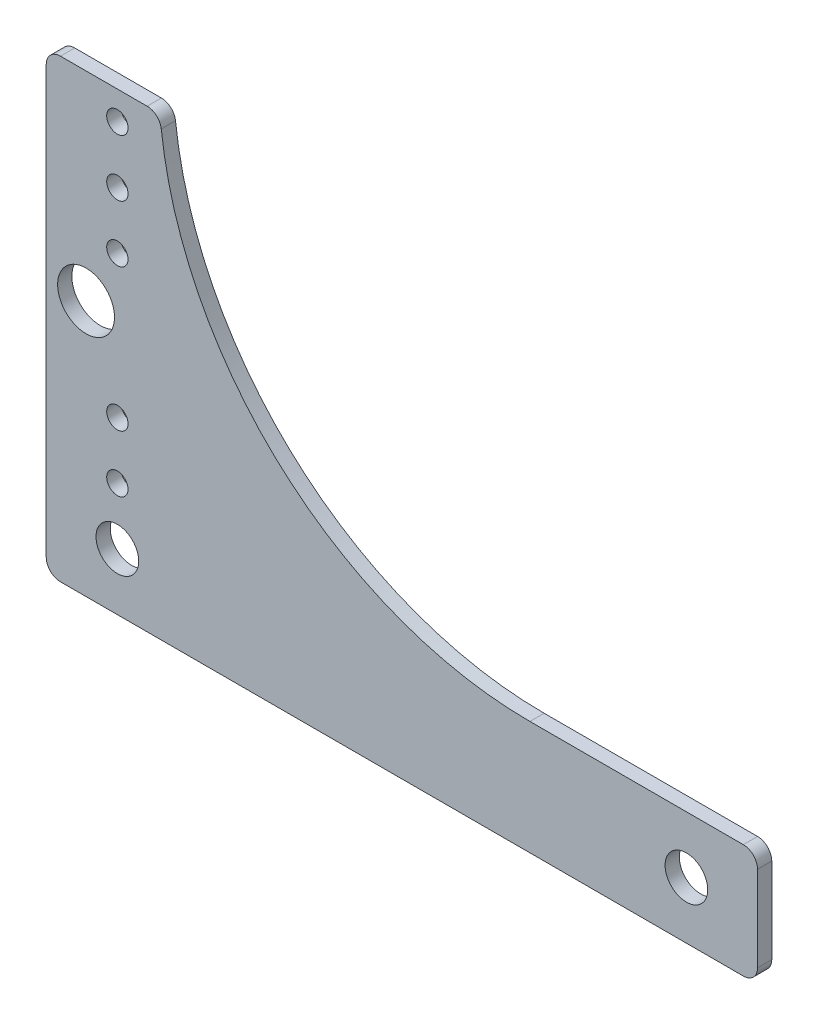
ISO-10303-21;
HEADER;
FILE_DESCRIPTION(('STEP AP214'),'2;1');
FILE_NAME('part.step','',(''),(''),'','','');
FILE_SCHEMA(('AUTOMOTIVE_DESIGN { 1 0 10303 214 1 1 1 1 }'));
ENDSEC;
DATA;
#1=APPLICATION_CONTEXT('core data for automotive mechanical design processes');
#2=APPLICATION_PROTOCOL_DEFINITION('international standard','automotive_design',2000,#1);
#3=PRODUCT_CONTEXT('',#1,'mechanical');
#4=PRODUCT('Part','Part','',(#3));
#5=PRODUCT_RELATED_PRODUCT_CATEGORY('part','',(#4));
#6=PRODUCT_DEFINITION_FORMATION('','',#4);
#7=PRODUCT_DEFINITION_CONTEXT('part definition',#1,'design');
#8=PRODUCT_DEFINITION('design','',#6,#7);
#9=PRODUCT_DEFINITION_SHAPE('','',#8);
#10=(LENGTH_UNIT() NAMED_UNIT(*) SI_UNIT(.MILLI.,.METRE.));
#11=(NAMED_UNIT(*) PLANE_ANGLE_UNIT() SI_UNIT($,.RADIAN.));
#12=(NAMED_UNIT(*) SI_UNIT($,.STERADIAN.) SOLID_ANGLE_UNIT());
#13=UNCERTAINTY_MEASURE_WITH_UNIT(LENGTH_MEASURE(1.E-05),#10,'distance_accuracy_value','');
#14=(GEOMETRIC_REPRESENTATION_CONTEXT(3) GLOBAL_UNCERTAINTY_ASSIGNED_CONTEXT((#13)) GLOBAL_UNIT_ASSIGNED_CONTEXT((#10,
#11,#12)) REPRESENTATION_CONTEXT('',''));
#15=CARTESIAN_POINT('',(0.,0.,0.));
#16=DIRECTION('',(0.,0.,1.));
#17=DIRECTION('',(1.,0.,0.));
#18=AXIS2_PLACEMENT_3D('',#15,#16,#17);
#19=CARTESIAN_POINT('',(158.75,25.4,3.175));
#20=DIRECTION('',(0.,1.,0.));
#21=DIRECTION('',(-1.,0.,0.));
#22=AXIS2_PLACEMENT_3D('',#19,#20,#21);
#23=PLANE('',#22);
#24=DIRECTION('',(-1.,0.,0.));
#25=VECTOR('',#24,1.);
#26=CARTESIAN_POINT('',(158.75,25.4,3.175));
#27=LINE('',#26,#25);
#28=CARTESIAN_POINT('',(155.575,25.4,3.175));
#29=VERTEX_POINT('',#28);
#30=CARTESIAN_POINT('',(107.95,25.4,3.175));
#31=VERTEX_POINT('',#30);
#32=EDGE_CURVE('E126',#29,#31,#27,.T.);
#33=ORIENTED_EDGE('',*,*,#32,.F.);
#34=DIRECTION('',(0.,0.,1.));
#35=VECTOR('',#34,1.);
#36=CARTESIAN_POINT('',(155.575,25.4,3.175));
#37=LINE('',#36,#35);
#38=CARTESIAN_POINT('',(155.575,25.4,0.));
#39=VERTEX_POINT('',#38);
#40=EDGE_CURVE('E49',#29,#39,#37,.F.);
#41=ORIENTED_EDGE('',*,*,#40,.T.);
#42=DIRECTION('',(1.,0.,0.));
#43=VECTOR('',#42,1.);
#44=CARTESIAN_POINT('',(107.95,25.4,0.));
#45=LINE('',#44,#43);
#46=CARTESIAN_POINT('',(107.95,25.4,0.));
#47=VERTEX_POINT('',#46);
#48=EDGE_CURVE('E140',#39,#47,#45,.F.);
#49=ORIENTED_EDGE('',*,*,#48,.T.);
#50=DIRECTION('',(0.,0.,1.));
#51=VECTOR('',#50,1.);
#52=CARTESIAN_POINT('',(107.95,25.4,3.175));
#53=LINE('',#52,#51);
#54=EDGE_CURVE('E139',#47,#31,#53,.T.);
#55=ORIENTED_EDGE('',*,*,#54,.T.);
#56=EDGE_LOOP('',(#33,#41,#49,#55));
#57=FACE_BOUND('',#56,.T.);
#58=ADVANCED_FACE('F41',(#57),#23,.T.);
#59=CARTESIAN_POINT('',(107.95,108.214583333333,3.175));
#60=DIRECTION('',(0.,0.,-1.));
#61=DIRECTION('',(-1.,0.,0.));
#62=AXIS2_PLACEMENT_3D('',#59,#60,#61);
#63=CYLINDRICAL_SURFACE('',#62,82.8145833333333);
#64=CARTESIAN_POINT('',(107.95,108.214583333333,0.));
#65=DIRECTION('',(0.,0.,-1.));
#66=DIRECTION('',(-1.,0.,0.));
#67=AXIS2_PLACEMENT_3D('',#64,#65,#66);
#68=CIRCLE('',#67,82.8145833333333);
#69=CARTESIAN_POINT('',(25.673844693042,98.7864615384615,0.));
#70=VERTEX_POINT('',#69);
#71=EDGE_CURVE('E168',#47,#70,#68,.T.);
#72=ORIENTED_EDGE('',*,*,#71,.T.);
#73=DIRECTION('',(0.,0.,-1.));
#74=VECTOR('',#73,1.);
#75=CARTESIAN_POINT('',(25.673844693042,98.7864615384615,3.175));
#76=LINE('',#75,#74);
#77=CARTESIAN_POINT('',(25.673844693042,98.7864615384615,3.175));
#78=VERTEX_POINT('',#77);
#79=EDGE_CURVE('E11',#70,#78,#76,.F.);
#80=ORIENTED_EDGE('',*,*,#79,.T.);
#81=CARTESIAN_POINT('',(107.95,108.214583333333,3.175));
#82=DIRECTION('',(0.,0.,-1.));
#83=DIRECTION('',(1.,0.,0.));
#84=AXIS2_PLACEMENT_3D('',#81,#82,#83);
#85=CIRCLE('',#84,82.8145833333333);
#86=EDGE_CURVE('E131',#31,#78,#85,.T.);
#87=ORIENTED_EDGE('',*,*,#86,.F.);
#88=ORIENTED_EDGE('',*,*,#54,.F.);
#89=EDGE_LOOP('',(#72,#80,#87,#88));
#90=FACE_BOUND('',#89,.T.);
#91=ADVANCED_FACE('F147',(#90),#63,.F.);
#92=CARTESIAN_POINT('',(0.,101.6,3.175));
#93=DIRECTION('',(0.,1.,0.));
#94=DIRECTION('',(-1.,0.,0.));
#95=AXIS2_PLACEMENT_3D('',#92,#93,#94);
#96=PLANE('',#95);
#97=DIRECTION('',(1.,0.,0.));
#98=VECTOR('',#97,1.);
#99=CARTESIAN_POINT('',(107.95,101.6,0.));
#100=LINE('',#99,#98);
#101=CARTESIAN_POINT('',(22.5194873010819,101.6,0.));
#102=VERTEX_POINT('',#101);
#103=CARTESIAN_POINT('',(3.175,101.6,0.));
#104=VERTEX_POINT('',#103);
#105=EDGE_CURVE('E165',#102,#104,#100,.F.);
#106=ORIENTED_EDGE('',*,*,#105,.T.);
#107=DIRECTION('',(0.,0.,1.));
#108=VECTOR('',#107,1.);
#109=CARTESIAN_POINT('',(3.175,101.6,3.175));
#110=LINE('',#109,#108);
#111=CARTESIAN_POINT('',(3.175,101.6,3.175));
#112=VERTEX_POINT('',#111);
#113=EDGE_CURVE('E173',#104,#112,#110,.T.);
#114=ORIENTED_EDGE('',*,*,#113,.T.);
#115=DIRECTION('',(-1.,0.,0.));
#116=VECTOR('',#115,1.);
#117=CARTESIAN_POINT('',(0.,101.6,3.175));
#118=LINE('',#117,#116);
#119=CARTESIAN_POINT('',(22.5194873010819,101.6,3.175));
#120=VERTEX_POINT('',#119);
#121=EDGE_CURVE('E149',#120,#112,#118,.T.);
#122=ORIENTED_EDGE('',*,*,#121,.F.);
#123=DIRECTION('',(0.,0.,-1.));
#124=VECTOR('',#123,1.);
#125=CARTESIAN_POINT('',(22.5194873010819,101.6,3.175));
#126=LINE('',#125,#124);
#127=EDGE_CURVE('E144',#120,#102,#126,.T.);
#128=ORIENTED_EDGE('',*,*,#127,.T.);
#129=EDGE_LOOP('',(#106,#114,#122,#128));
#130=FACE_BOUND('',#129,.T.);
#131=ADVANCED_FACE('F310',(#130),#96,.T.);
#132=CARTESIAN_POINT('',(0.,0.,3.175));
#133=DIRECTION('',(-1.,0.,0.));
#134=DIRECTION('',(0.,-1.,0.));
#135=AXIS2_PLACEMENT_3D('',#132,#133,#134);
#136=PLANE('',#135);
#137=DIRECTION('',(0.,-1.,0.));
#138=VECTOR('',#137,1.);
#139=CARTESIAN_POINT('',(0.,0.,3.175));
#140=LINE('',#139,#138);
#141=CARTESIAN_POINT('',(0.,98.425,3.175));
#142=VERTEX_POINT('',#141);
#143=CARTESIAN_POINT('',(0.,3.175,3.175));
#144=VERTEX_POINT('',#143);
#145=EDGE_CURVE('E145',#142,#144,#140,.T.);
#146=ORIENTED_EDGE('',*,*,#145,.F.);
#147=DIRECTION('',(0.,0.,1.));
#148=VECTOR('',#147,1.);
#149=CARTESIAN_POINT('',(0.,98.425,3.175));
#150=LINE('',#149,#148);
#151=CARTESIAN_POINT('',(0.,98.425,0.));
#152=VERTEX_POINT('',#151);
#153=EDGE_CURVE('E188',#142,#152,#150,.F.);
#154=ORIENTED_EDGE('',*,*,#153,.T.);
#155=DIRECTION('',(0.,1.,0.));
#156=VECTOR('',#155,1.);
#157=CARTESIAN_POINT('',(0.,108.214583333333,0.));
#158=LINE('',#157,#156);
#159=CARTESIAN_POINT('',(0.,3.175,0.));
#160=VERTEX_POINT('',#159);
#161=EDGE_CURVE('E161',#152,#160,#158,.F.);
#162=ORIENTED_EDGE('',*,*,#161,.T.);
#163=DIRECTION('',(0.,0.,1.));
#164=VECTOR('',#163,1.);
#165=CARTESIAN_POINT('',(0.,3.175,3.175));
#166=LINE('',#165,#164);
#167=EDGE_CURVE('E185',#160,#144,#166,.T.);
#168=ORIENTED_EDGE('',*,*,#167,.T.);
#169=EDGE_LOOP('',(#146,#154,#162,#168));
#170=FACE_BOUND('',#169,.T.);
#171=ADVANCED_FACE('F344',(#170),#136,.T.);
#172=CARTESIAN_POINT('',(0.,0.,3.175));
#173=DIRECTION('',(0.,-1.,0.));
#174=DIRECTION('',(1.,0.,0.));
#175=AXIS2_PLACEMENT_3D('',#172,#173,#174);
#176=PLANE('',#175);
#177=DIRECTION('',(1.,0.,0.));
#178=VECTOR('',#177,1.);
#179=CARTESIAN_POINT('',(0.,0.,3.175));
#180=LINE('',#179,#178);
#181=CARTESIAN_POINT('',(3.175,0.,3.175));
#182=VERTEX_POINT('',#181);
#183=CARTESIAN_POINT('',(155.575,0.,3.175));
#184=VERTEX_POINT('',#183);
#185=EDGE_CURVE('E164',#182,#184,#180,.T.);
#186=ORIENTED_EDGE('',*,*,#185,.F.);
#187=DIRECTION('',(0.,0.,1.));
#188=VECTOR('',#187,1.);
#189=CARTESIAN_POINT('',(3.175,0.,3.175));
#190=LINE('',#189,#188);
#191=CARTESIAN_POINT('',(3.175,0.,0.));
#192=VERTEX_POINT('',#191);
#193=EDGE_CURVE('E202',#182,#192,#190,.F.);
#194=ORIENTED_EDGE('',*,*,#193,.T.);
#195=DIRECTION('',(1.,0.,0.));
#196=VECTOR('',#195,1.);
#197=CARTESIAN_POINT('',(107.95,0.,0.));
#198=LINE('',#197,#196);
#199=CARTESIAN_POINT('',(155.575,0.,0.));
#200=VERTEX_POINT('',#199);
#201=EDGE_CURVE('E156',#192,#200,#198,.T.);
#202=ORIENTED_EDGE('',*,*,#201,.T.);
#203=DIRECTION('',(0.,0.,1.));
#204=VECTOR('',#203,1.);
#205=CARTESIAN_POINT('',(155.575,0.,3.175));
#206=LINE('',#205,#204);
#207=EDGE_CURVE('E199',#200,#184,#206,.T.);
#208=ORIENTED_EDGE('',*,*,#207,.T.);
#209=EDGE_LOOP('',(#186,#194,#202,#208));
#210=FACE_BOUND('',#209,.T.);
#211=ADVANCED_FACE('F316',(#210),#176,.T.);
#212=CARTESIAN_POINT('',(158.75,0.,3.175));
#213=DIRECTION('',(1.,0.,0.));
#214=DIRECTION('',(0.,1.,0.));
#215=AXIS2_PLACEMENT_3D('',#212,#213,#214);
#216=PLANE('',#215);
#217=DIRECTION('',(0.,1.,0.));
#218=VECTOR('',#217,1.);
#219=CARTESIAN_POINT('',(158.75,0.,3.175));
#220=LINE('',#219,#218);
#221=CARTESIAN_POINT('',(158.75,3.175,3.175));
#222=VERTEX_POINT('',#221);
#223=CARTESIAN_POINT('',(158.75,22.225,3.175));
#224=VERTEX_POINT('',#223);
#225=EDGE_CURVE('E136',#222,#224,#220,.T.);
#226=ORIENTED_EDGE('',*,*,#225,.F.);
#227=DIRECTION('',(0.,0.,1.));
#228=VECTOR('',#227,1.);
#229=CARTESIAN_POINT('',(158.75,3.175,3.175));
#230=LINE('',#229,#228);
#231=CARTESIAN_POINT('',(158.75,3.175,0.));
#232=VERTEX_POINT('',#231);
#233=EDGE_CURVE('E63',#222,#232,#230,.F.);
#234=ORIENTED_EDGE('',*,*,#233,.T.);
#235=DIRECTION('',(0.,1.,0.));
#236=VECTOR('',#235,1.);
#237=CARTESIAN_POINT('',(158.75,108.214583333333,0.));
#238=LINE('',#237,#236);
#239=CARTESIAN_POINT('',(158.75,22.225,0.));
#240=VERTEX_POINT('',#239);
#241=EDGE_CURVE('E159',#232,#240,#238,.T.);
#242=ORIENTED_EDGE('',*,*,#241,.T.);
#243=DIRECTION('',(0.,0.,1.));
#244=VECTOR('',#243,1.);
#245=CARTESIAN_POINT('',(158.75,22.225,3.175));
#246=LINE('',#245,#244);
#247=EDGE_CURVE('E204',#240,#224,#246,.T.);
#248=ORIENTED_EDGE('',*,*,#247,.T.);
#249=EDGE_LOOP('',(#226,#234,#242,#248));
#250=FACE_BOUND('',#249,.T.);
#251=ADVANCED_FACE('F212',(#250),#216,.T.);
#252=CARTESIAN_POINT('',(107.95,108.214583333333,3.175));
#253=DIRECTION('',(0.,0.,1.));
#254=DIRECTION('',(1.,0.,0.));
#255=AXIS2_PLACEMENT_3D('',#252,#253,#254);
#256=PLANE('',#255);
#257=CARTESIAN_POINT('',(142.875,12.6999999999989,3.175));
#258=DIRECTION('',(0.,0.,1.));
#259=DIRECTION('',(1.,0.,0.));
#260=AXIS2_PLACEMENT_3D('',#257,#258,#259);
#261=CIRCLE('',#260,4.76250000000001);
#262=CARTESIAN_POINT('',(147.6375,12.6999999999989,3.175));
#263=VERTEX_POINT('',#262);
#264=EDGE_CURVE('E258',#263,#263,#261,.T.);
#265=ORIENTED_EDGE('',*,*,#264,.F.);
#266=EDGE_LOOP('',(#265));
#267=FACE_BOUND('',#266,.T.);
#268=CARTESIAN_POINT('',(15.8750000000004,95.2499999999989,3.175));
#269=DIRECTION('',(0.,0.,-1.));
#270=DIRECTION('',(-1.,0.,0.));
#271=AXIS2_PLACEMENT_3D('',#268,#269,#270);
#272=CIRCLE('',#271,2.38125);
#273=CARTESIAN_POINT('',(13.4937500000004,95.2499999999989,3.175));
#274=VERTEX_POINT('',#273);
#275=EDGE_CURVE('E252',#274,#274,#272,.F.);
#276=ORIENTED_EDGE('',*,*,#275,.F.);
#277=EDGE_LOOP('',(#276));
#278=FACE_BOUND('',#277,.T.);
#279=CARTESIAN_POINT('',(15.8750000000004,82.5499999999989,3.175));
#280=DIRECTION('',(0.,0.,-1.));
#281=DIRECTION('',(-1.,0.,0.));
#282=AXIS2_PLACEMENT_3D('',#279,#280,#281);
#283=CIRCLE('',#282,2.38125);
#284=CARTESIAN_POINT('',(13.4937500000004,82.5499999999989,3.175));
#285=VERTEX_POINT('',#284);
#286=EDGE_CURVE('E246',#285,#285,#283,.F.);
#287=ORIENTED_EDGE('',*,*,#286,.F.);
#288=EDGE_LOOP('',(#287));
#289=FACE_BOUND('',#288,.T.);
#290=CARTESIAN_POINT('',(15.8750000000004,69.8499999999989,3.175));
#291=DIRECTION('',(0.,0.,-1.));
#292=DIRECTION('',(-1.,0.,0.));
#293=AXIS2_PLACEMENT_3D('',#290,#291,#292);
#294=CIRCLE('',#293,2.38125);
#295=CARTESIAN_POINT('',(13.4937500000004,69.8499999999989,3.175));
#296=VERTEX_POINT('',#295);
#297=EDGE_CURVE('E240',#296,#296,#294,.F.);
#298=ORIENTED_EDGE('',*,*,#297,.F.);
#299=EDGE_LOOP('',(#298));
#300=FACE_BOUND('',#299,.T.);
#301=CARTESIAN_POINT('',(8.89000000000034,57.1499999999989,3.175));
#302=DIRECTION('',(0.,0.,-1.));
#303=DIRECTION('',(-1.,0.,0.));
#304=AXIS2_PLACEMENT_3D('',#301,#302,#303);
#305=CIRCLE('',#304,6.35);
#306=CARTESIAN_POINT('',(2.54000000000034,57.1499999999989,3.175));
#307=VERTEX_POINT('',#306);
#308=EDGE_CURVE('E234',#307,#307,#305,.F.);
#309=ORIENTED_EDGE('',*,*,#308,.F.);
#310=EDGE_LOOP('',(#309));
#311=FACE_BOUND('',#310,.T.);
#312=CARTESIAN_POINT('',(15.8750000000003,38.0999999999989,3.175));
#313=DIRECTION('',(0.,0.,-1.));
#314=DIRECTION('',(-1.,0.,0.));
#315=AXIS2_PLACEMENT_3D('',#312,#313,#314);
#316=CIRCLE('',#315,2.38125);
#317=CARTESIAN_POINT('',(13.4937500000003,38.0999999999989,3.175));
#318=VERTEX_POINT('',#317);
#319=EDGE_CURVE('E228',#318,#318,#316,.F.);
#320=ORIENTED_EDGE('',*,*,#319,.F.);
#321=EDGE_LOOP('',(#320));
#322=FACE_BOUND('',#321,.T.);
#323=CARTESIAN_POINT('',(15.8750000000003,25.3999999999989,3.175));
#324=DIRECTION('',(0.,0.,-1.));
#325=DIRECTION('',(-1.,0.,0.));
#326=AXIS2_PLACEMENT_3D('',#323,#324,#325);
#327=CIRCLE('',#326,2.38125);
#328=CARTESIAN_POINT('',(13.4937500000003,25.3999999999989,3.175));
#329=VERTEX_POINT('',#328);
#330=EDGE_CURVE('E222',#329,#329,#327,.F.);
#331=ORIENTED_EDGE('',*,*,#330,.F.);
#332=EDGE_LOOP('',(#331));
#333=FACE_BOUND('',#332,.T.);
#334=CARTESIAN_POINT('',(15.8750000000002,12.6999999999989,3.175));
#335=DIRECTION('',(0.,0.,-1.));
#336=DIRECTION('',(-1.,0.,0.));
#337=AXIS2_PLACEMENT_3D('',#334,#335,#336);
#338=CIRCLE('',#337,4.7625);
#339=CARTESIAN_POINT('',(11.1125000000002,12.6999999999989,3.175));
#340=VERTEX_POINT('',#339);
#341=EDGE_CURVE('E216',#340,#340,#338,.F.);
#342=ORIENTED_EDGE('',*,*,#341,.F.);
#343=EDGE_LOOP('',(#342));
#344=FACE_BOUND('',#343,.T.);
#345=ORIENTED_EDGE('',*,*,#121,.T.);
#346=CARTESIAN_POINT('',(3.175,98.425,3.175));
#347=DIRECTION('',(0.,0.,1.));
#348=DIRECTION('',(1.,0.,0.));
#349=AXIS2_PLACEMENT_3D('',#346,#347,#348);
#350=CIRCLE('',#349,3.175);
#351=EDGE_CURVE('E183',#112,#142,#350,.T.);
#352=ORIENTED_EDGE('',*,*,#351,.T.);
#353=ORIENTED_EDGE('',*,*,#145,.T.);
#354=CARTESIAN_POINT('',(3.175,3.175,3.175));
#355=DIRECTION('',(0.,0.,1.));
#356=DIRECTION('',(1.,0.,0.));
#357=AXIS2_PLACEMENT_3D('',#354,#355,#356);
#358=CIRCLE('',#357,3.175);
#359=EDGE_CURVE('E181',#144,#182,#358,.T.);
#360=ORIENTED_EDGE('',*,*,#359,.T.);
#361=ORIENTED_EDGE('',*,*,#185,.T.);
#362=CARTESIAN_POINT('',(155.575,3.175,3.175));
#363=DIRECTION('',(0.,0.,1.));
#364=DIRECTION('',(1.,0.,0.));
#365=AXIS2_PLACEMENT_3D('',#362,#363,#364);
#366=CIRCLE('',#365,3.175);
#367=EDGE_CURVE('E179',#184,#222,#366,.T.);
#368=ORIENTED_EDGE('',*,*,#367,.T.);
#369=ORIENTED_EDGE('',*,*,#225,.T.);
#370=CARTESIAN_POINT('',(155.575,22.225,3.175));
#371=DIRECTION('',(0.,0.,1.));
#372=DIRECTION('',(1.,0.,0.));
#373=AXIS2_PLACEMENT_3D('',#370,#371,#372);
#374=CIRCLE('',#373,3.175);
#375=EDGE_CURVE('E133',#224,#29,#374,.T.);
#376=ORIENTED_EDGE('',*,*,#375,.T.);
#377=ORIENTED_EDGE('',*,*,#32,.T.);
#378=ORIENTED_EDGE('',*,*,#86,.T.);
#379=CARTESIAN_POINT('',(22.5194873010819,98.425,3.175));
#380=DIRECTION('',(0.,0.,1.));
#381=DIRECTION('',(1.,0.,0.));
#382=AXIS2_PLACEMENT_3D('',#379,#380,#381);
#383=CIRCLE('',#382,3.175);
#384=EDGE_CURVE('E176',#78,#120,#383,.T.);
#385=ORIENTED_EDGE('',*,*,#384,.T.);
#386=EDGE_LOOP('',(#345,#352,#353,#360,#361,#368,#369,#376,#377,#378,#385));
#387=FACE_BOUND('',#386,.T.);
#388=ADVANCED_FACE('F129',(#267,#278,#289,#300,#311,#322,#333,#344,#387),#256,.T.);
#389=CARTESIAN_POINT('',(107.95,108.214583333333,0.));
#390=DIRECTION('',(0.,0.,1.));
#391=DIRECTION('',(1.,0.,0.));
#392=AXIS2_PLACEMENT_3D('',#389,#390,#391);
#393=PLANE('',#392);
#394=CARTESIAN_POINT('',(142.875,12.6999999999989,0.));
#395=DIRECTION('',(0.,0.,1.));
#396=DIRECTION('',(1.,0.,0.));
#397=AXIS2_PLACEMENT_3D('',#394,#395,#396);
#398=CIRCLE('',#397,4.76250000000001);
#399=CARTESIAN_POINT('',(147.6375,12.6999999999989,0.));
#400=VERTEX_POINT('',#399);
#401=EDGE_CURVE('E255',#400,#400,#398,.T.);
#402=ORIENTED_EDGE('',*,*,#401,.T.);
#403=EDGE_LOOP('',(#402));
#404=FACE_BOUND('',#403,.T.);
#405=CARTESIAN_POINT('',(15.8750000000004,95.2499999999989,0.));
#406=DIRECTION('',(0.,0.,-1.));
#407=DIRECTION('',(-1.,0.,0.));
#408=AXIS2_PLACEMENT_3D('',#405,#406,#407);
#409=CIRCLE('',#408,2.38125);
#410=CARTESIAN_POINT('',(13.4937500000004,95.2499999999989,0.));
#411=VERTEX_POINT('',#410);
#412=EDGE_CURVE('E249',#411,#411,#409,.F.);
#413=ORIENTED_EDGE('',*,*,#412,.T.);
#414=EDGE_LOOP('',(#413));
#415=FACE_BOUND('',#414,.T.);
#416=CARTESIAN_POINT('',(15.8750000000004,82.5499999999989,0.));
#417=DIRECTION('',(0.,0.,-1.));
#418=DIRECTION('',(-1.,0.,0.));
#419=AXIS2_PLACEMENT_3D('',#416,#417,#418);
#420=CIRCLE('',#419,2.38125);
#421=CARTESIAN_POINT('',(13.4937500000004,82.5499999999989,0.));
#422=VERTEX_POINT('',#421);
#423=EDGE_CURVE('E243',#422,#422,#420,.F.);
#424=ORIENTED_EDGE('',*,*,#423,.T.);
#425=EDGE_LOOP('',(#424));
#426=FACE_BOUND('',#425,.T.);
#427=CARTESIAN_POINT('',(15.8750000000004,69.8499999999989,0.));
#428=DIRECTION('',(0.,0.,-1.));
#429=DIRECTION('',(-1.,0.,0.));
#430=AXIS2_PLACEMENT_3D('',#427,#428,#429);
#431=CIRCLE('',#430,2.38125);
#432=CARTESIAN_POINT('',(13.4937500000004,69.8499999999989,0.));
#433=VERTEX_POINT('',#432);
#434=EDGE_CURVE('E237',#433,#433,#431,.F.);
#435=ORIENTED_EDGE('',*,*,#434,.T.);
#436=EDGE_LOOP('',(#435));
#437=FACE_BOUND('',#436,.T.);
#438=CARTESIAN_POINT('',(8.89000000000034,57.1499999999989,0.));
#439=DIRECTION('',(0.,0.,-1.));
#440=DIRECTION('',(-1.,0.,0.));
#441=AXIS2_PLACEMENT_3D('',#438,#439,#440);
#442=CIRCLE('',#441,6.35);
#443=CARTESIAN_POINT('',(2.54000000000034,57.1499999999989,0.));
#444=VERTEX_POINT('',#443);
#445=EDGE_CURVE('E231',#444,#444,#442,.F.);
#446=ORIENTED_EDGE('',*,*,#445,.T.);
#447=EDGE_LOOP('',(#446));
#448=FACE_BOUND('',#447,.T.);
#449=CARTESIAN_POINT('',(15.8750000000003,38.0999999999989,0.));
#450=DIRECTION('',(0.,0.,-1.));
#451=DIRECTION('',(-1.,0.,0.));
#452=AXIS2_PLACEMENT_3D('',#449,#450,#451);
#453=CIRCLE('',#452,2.38125);
#454=CARTESIAN_POINT('',(13.4937500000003,38.0999999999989,0.));
#455=VERTEX_POINT('',#454);
#456=EDGE_CURVE('E225',#455,#455,#453,.F.);
#457=ORIENTED_EDGE('',*,*,#456,.T.);
#458=EDGE_LOOP('',(#457));
#459=FACE_BOUND('',#458,.T.);
#460=CARTESIAN_POINT('',(15.8750000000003,25.3999999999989,0.));
#461=DIRECTION('',(0.,0.,-1.));
#462=DIRECTION('',(-1.,0.,0.));
#463=AXIS2_PLACEMENT_3D('',#460,#461,#462);
#464=CIRCLE('',#463,2.38125);
#465=CARTESIAN_POINT('',(13.4937500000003,25.3999999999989,0.));
#466=VERTEX_POINT('',#465);
#467=EDGE_CURVE('E219',#466,#466,#464,.F.);
#468=ORIENTED_EDGE('',*,*,#467,.T.);
#469=EDGE_LOOP('',(#468));
#470=FACE_BOUND('',#469,.T.);
#471=CARTESIAN_POINT('',(15.8750000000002,12.6999999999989,0.));
#472=DIRECTION('',(0.,0.,-1.));
#473=DIRECTION('',(-1.,0.,0.));
#474=AXIS2_PLACEMENT_3D('',#471,#472,#473);
#475=CIRCLE('',#474,4.7625);
#476=CARTESIAN_POINT('',(11.1125000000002,12.6999999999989,0.));
#477=VERTEX_POINT('',#476);
#478=EDGE_CURVE('E160',#477,#477,#475,.F.);
#479=ORIENTED_EDGE('',*,*,#478,.T.);
#480=EDGE_LOOP('',(#479));
#481=FACE_BOUND('',#480,.T.);
#482=ORIENTED_EDGE('',*,*,#161,.F.);
#483=CARTESIAN_POINT('',(3.175,98.425,0.));
#484=DIRECTION('',(0.,0.,1.));
#485=DIRECTION('',(1.,0.,0.));
#486=AXIS2_PLACEMENT_3D('',#483,#484,#485);
#487=CIRCLE('',#486,3.175);
#488=EDGE_CURVE('E197',#152,#104,#487,.F.);
#489=ORIENTED_EDGE('',*,*,#488,.T.);
#490=ORIENTED_EDGE('',*,*,#105,.F.);
#491=CARTESIAN_POINT('',(22.5194873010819,98.425,0.));
#492=DIRECTION('',(0.,0.,1.));
#493=DIRECTION('',(1.,0.,0.));
#494=AXIS2_PLACEMENT_3D('',#491,#492,#493);
#495=CIRCLE('',#494,3.175);
#496=EDGE_CURVE('E190',#102,#70,#495,.F.);
#497=ORIENTED_EDGE('',*,*,#496,.T.);
#498=ORIENTED_EDGE('',*,*,#71,.F.);
#499=ORIENTED_EDGE('',*,*,#48,.F.);
#500=CARTESIAN_POINT('',(155.575,22.225,0.));
#501=DIRECTION('',(0.,0.,1.));
#502=DIRECTION('',(1.,0.,0.));
#503=AXIS2_PLACEMENT_3D('',#500,#501,#502);
#504=CIRCLE('',#503,3.175);
#505=EDGE_CURVE('E56',#39,#240,#504,.F.);
#506=ORIENTED_EDGE('',*,*,#505,.T.);
#507=ORIENTED_EDGE('',*,*,#241,.F.);
#508=CARTESIAN_POINT('',(155.575,3.175,0.));
#509=DIRECTION('',(0.,0.,1.));
#510=DIRECTION('',(1.,0.,0.));
#511=AXIS2_PLACEMENT_3D('',#508,#509,#510);
#512=CIRCLE('',#511,3.175);
#513=EDGE_CURVE('E193',#232,#200,#512,.F.);
#514=ORIENTED_EDGE('',*,*,#513,.T.);
#515=ORIENTED_EDGE('',*,*,#201,.F.);
#516=CARTESIAN_POINT('',(3.175,3.175,0.));
#517=DIRECTION('',(0.,0.,1.));
#518=DIRECTION('',(1.,0.,0.));
#519=AXIS2_PLACEMENT_3D('',#516,#517,#518);
#520=CIRCLE('',#519,3.175);
#521=EDGE_CURVE('E195',#192,#160,#520,.F.);
#522=ORIENTED_EDGE('',*,*,#521,.T.);
#523=EDGE_LOOP('',(#482,#489,#490,#497,#498,#499,#506,#507,#514,#515,#522));
#524=FACE_BOUND('',#523,.T.);
#525=ADVANCED_FACE('F209',(#404,#415,#426,#437,#448,#459,#470,#481,#524),#393,.F.);
#526=CARTESIAN_POINT('',(15.8750000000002,12.6999999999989,0.));
#527=DIRECTION('',(0.,0.,1.));
#528=DIRECTION('',(0.,-1.,0.));
#529=AXIS2_PLACEMENT_3D('',#526,#527,#528);
#530=CYLINDRICAL_SURFACE('',#529,4.7625);
#531=ORIENTED_EDGE('',*,*,#478,.F.);
#532=EDGE_LOOP('',(#531));
#533=FACE_BOUND('',#532,.T.);
#534=ORIENTED_EDGE('',*,*,#341,.T.);
#535=EDGE_LOOP('',(#534));
#536=FACE_BOUND('',#535,.T.);
#537=ADVANCED_FACE('F291',(#533,#536),#530,.F.);
#538=CARTESIAN_POINT('',(15.8750000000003,25.3999999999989,0.));
#539=DIRECTION('',(0.,0.,1.));
#540=DIRECTION('',(0.,-1.,0.));
#541=AXIS2_PLACEMENT_3D('',#538,#539,#540);
#542=CYLINDRICAL_SURFACE('',#541,2.38125);
#543=ORIENTED_EDGE('',*,*,#467,.F.);
#544=EDGE_LOOP('',(#543));
#545=FACE_BOUND('',#544,.T.);
#546=ORIENTED_EDGE('',*,*,#330,.T.);
#547=EDGE_LOOP('',(#546));
#548=FACE_BOUND('',#547,.T.);
#549=ADVANCED_FACE('F293',(#545,#548),#542,.F.);
#550=CARTESIAN_POINT('',(15.8750000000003,38.0999999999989,0.));
#551=DIRECTION('',(0.,0.,1.));
#552=DIRECTION('',(0.,-1.,0.));
#553=AXIS2_PLACEMENT_3D('',#550,#551,#552);
#554=CYLINDRICAL_SURFACE('',#553,2.38125);
#555=ORIENTED_EDGE('',*,*,#456,.F.);
#556=EDGE_LOOP('',(#555));
#557=FACE_BOUND('',#556,.T.);
#558=ORIENTED_EDGE('',*,*,#319,.T.);
#559=EDGE_LOOP('',(#558));
#560=FACE_BOUND('',#559,.T.);
#561=ADVANCED_FACE('F300',(#557,#560),#554,.F.);
#562=CARTESIAN_POINT('',(8.89000000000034,57.1499999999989,0.));
#563=DIRECTION('',(0.,0.,1.));
#564=DIRECTION('',(0.,-1.,0.));
#565=AXIS2_PLACEMENT_3D('',#562,#563,#564);
#566=CYLINDRICAL_SURFACE('',#565,6.35);
#567=ORIENTED_EDGE('',*,*,#445,.F.);
#568=EDGE_LOOP('',(#567));
#569=FACE_BOUND('',#568,.T.);
#570=ORIENTED_EDGE('',*,*,#308,.T.);
#571=EDGE_LOOP('',(#570));
#572=FACE_BOUND('',#571,.T.);
#573=ADVANCED_FACE('F450',(#569,#572),#566,.F.);
#574=CARTESIAN_POINT('',(15.8750000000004,69.8499999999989,0.));
#575=DIRECTION('',(0.,0.,1.));
#576=DIRECTION('',(0.,-1.,0.));
#577=AXIS2_PLACEMENT_3D('',#574,#575,#576);
#578=CYLINDRICAL_SURFACE('',#577,2.38125);
#579=ORIENTED_EDGE('',*,*,#434,.F.);
#580=EDGE_LOOP('',(#579));
#581=FACE_BOUND('',#580,.T.);
#582=ORIENTED_EDGE('',*,*,#297,.T.);
#583=EDGE_LOOP('',(#582));
#584=FACE_BOUND('',#583,.T.);
#585=ADVANCED_FACE('F442',(#581,#584),#578,.F.);
#586=CARTESIAN_POINT('',(15.8750000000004,82.5499999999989,0.));
#587=DIRECTION('',(0.,0.,1.));
#588=DIRECTION('',(0.,-1.,0.));
#589=AXIS2_PLACEMENT_3D('',#586,#587,#588);
#590=CYLINDRICAL_SURFACE('',#589,2.38125);
#591=ORIENTED_EDGE('',*,*,#423,.F.);
#592=EDGE_LOOP('',(#591));
#593=FACE_BOUND('',#592,.T.);
#594=ORIENTED_EDGE('',*,*,#286,.T.);
#595=EDGE_LOOP('',(#594));
#596=FACE_BOUND('',#595,.T.);
#597=ADVANCED_FACE('F434',(#593,#596),#590,.F.);
#598=CARTESIAN_POINT('',(15.8750000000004,95.2499999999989,0.));
#599=DIRECTION('',(0.,0.,1.));
#600=DIRECTION('',(0.,-1.,0.));
#601=AXIS2_PLACEMENT_3D('',#598,#599,#600);
#602=CYLINDRICAL_SURFACE('',#601,2.38125);
#603=ORIENTED_EDGE('',*,*,#412,.F.);
#604=EDGE_LOOP('',(#603));
#605=FACE_BOUND('',#604,.T.);
#606=ORIENTED_EDGE('',*,*,#275,.T.);
#607=EDGE_LOOP('',(#606));
#608=FACE_BOUND('',#607,.T.);
#609=ADVANCED_FACE('F270',(#605,#608),#602,.F.);
#610=CARTESIAN_POINT('',(142.875,12.6999999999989,0.));
#611=DIRECTION('',(0.,0.,1.));
#612=DIRECTION('',(1.,0.,0.));
#613=AXIS2_PLACEMENT_3D('',#610,#611,#612);
#614=CYLINDRICAL_SURFACE('',#613,4.76250000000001);
#615=ORIENTED_EDGE('',*,*,#401,.F.);
#616=EDGE_LOOP('',(#615));
#617=FACE_BOUND('',#616,.T.);
#618=ORIENTED_EDGE('',*,*,#264,.T.);
#619=EDGE_LOOP('',(#618));
#620=FACE_BOUND('',#619,.T.);
#621=ADVANCED_FACE('F266',(#617,#620),#614,.F.);
#622=CARTESIAN_POINT('',(3.175,98.425,3.175));
#623=DIRECTION('',(0.,0.,1.));
#624=DIRECTION('',(1.,0.,0.));
#625=AXIS2_PLACEMENT_3D('',#622,#623,#624);
#626=CYLINDRICAL_SURFACE('',#625,3.175);
#627=ORIENTED_EDGE('',*,*,#488,.F.);
#628=ORIENTED_EDGE('',*,*,#153,.F.);
#629=ORIENTED_EDGE('',*,*,#351,.F.);
#630=ORIENTED_EDGE('',*,*,#113,.F.);
#631=EDGE_LOOP('',(#627,#628,#629,#630));
#632=FACE_BOUND('',#631,.T.);
#633=ADVANCED_FACE('F269',(#632),#626,.T.);
#634=CARTESIAN_POINT('',(3.175,3.175,3.175));
#635=DIRECTION('',(0.,0.,1.));
#636=DIRECTION('',(1.,0.,0.));
#637=AXIS2_PLACEMENT_3D('',#634,#635,#636);
#638=CYLINDRICAL_SURFACE('',#637,3.175);
#639=ORIENTED_EDGE('',*,*,#521,.F.);
#640=ORIENTED_EDGE('',*,*,#193,.F.);
#641=ORIENTED_EDGE('',*,*,#359,.F.);
#642=ORIENTED_EDGE('',*,*,#167,.F.);
#643=EDGE_LOOP('',(#639,#640,#641,#642));
#644=FACE_BOUND('',#643,.T.);
#645=ADVANCED_FACE('F319',(#644),#638,.T.);
#646=CARTESIAN_POINT('',(155.575,3.175,3.175));
#647=DIRECTION('',(0.,0.,1.));
#648=DIRECTION('',(1.,0.,0.));
#649=AXIS2_PLACEMENT_3D('',#646,#647,#648);
#650=CYLINDRICAL_SURFACE('',#649,3.175);
#651=ORIENTED_EDGE('',*,*,#513,.F.);
#652=ORIENTED_EDGE('',*,*,#233,.F.);
#653=ORIENTED_EDGE('',*,*,#367,.F.);
#654=ORIENTED_EDGE('',*,*,#207,.F.);
#655=EDGE_LOOP('',(#651,#652,#653,#654));
#656=FACE_BOUND('',#655,.T.);
#657=ADVANCED_FACE('F323',(#656),#650,.T.);
#658=CARTESIAN_POINT('',(155.575,22.225,3.175));
#659=DIRECTION('',(0.,0.,1.));
#660=DIRECTION('',(1.,0.,0.));
#661=AXIS2_PLACEMENT_3D('',#658,#659,#660);
#662=CYLINDRICAL_SURFACE('',#661,3.175);
#663=ORIENTED_EDGE('',*,*,#505,.F.);
#664=ORIENTED_EDGE('',*,*,#40,.F.);
#665=ORIENTED_EDGE('',*,*,#375,.F.);
#666=ORIENTED_EDGE('',*,*,#247,.F.);
#667=EDGE_LOOP('',(#663,#664,#665,#666));
#668=FACE_BOUND('',#667,.T.);
#669=ADVANCED_FACE('F211',(#668),#662,.T.);
#670=CARTESIAN_POINT('',(22.5194873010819,98.425,3.175));
#671=DIRECTION('',(0.,0.,-1.));
#672=DIRECTION('',(-1.,0.,0.));
#673=AXIS2_PLACEMENT_3D('',#670,#671,#672);
#674=CYLINDRICAL_SURFACE('',#673,3.175);
#675=ORIENTED_EDGE('',*,*,#496,.F.);
#676=ORIENTED_EDGE('',*,*,#127,.F.);
#677=ORIENTED_EDGE('',*,*,#384,.F.);
#678=ORIENTED_EDGE('',*,*,#79,.F.);
#679=EDGE_LOOP('',(#675,#676,#677,#678));
#680=FACE_BOUND('',#679,.T.);
#681=ADVANCED_FACE('F43',(#680),#674,.T.);
#682=CLOSED_SHELL('',(#58,#91,#131,#171,#211,#251,#388,#525,#537,#549,#561,#573,#585,#597,#609,
#621,#633,#645,#657,#669,#681));
#683=MANIFOLD_SOLID_BREP('B2',#682);
#684=ADVANCED_BREP_SHAPE_REPRESENTATION('',(#18,#683),#14);
#685=SHAPE_DEFINITION_REPRESENTATION(#9,#684);
ENDSEC;
END-ISO-10303-21;
